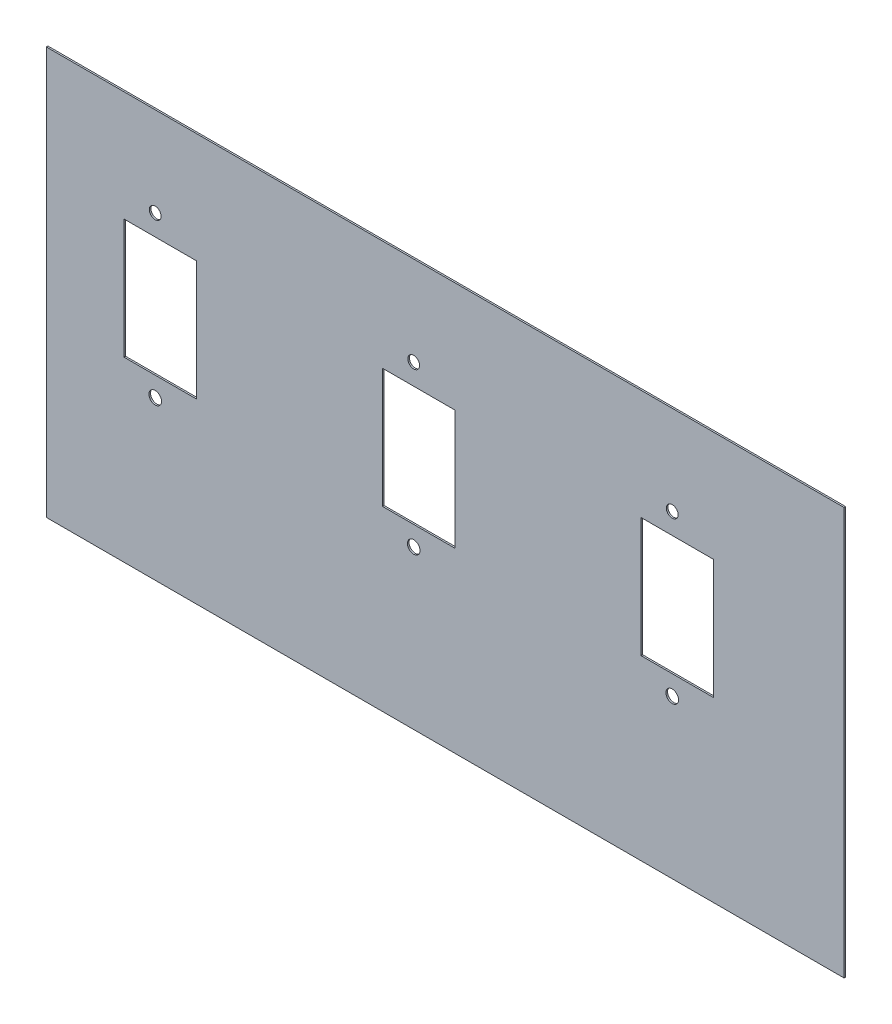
ISO-10303-21;
HEADER;
FILE_DESCRIPTION(('STEP AP214'),'2;1');
FILE_NAME('part.step','',(''),(''),'','','');
FILE_SCHEMA(('AUTOMOTIVE_DESIGN { 1 0 10303 214 1 1 1 1 }'));
ENDSEC;
DATA;
#1=APPLICATION_CONTEXT('core data for automotive mechanical design processes');
#2=APPLICATION_PROTOCOL_DEFINITION('international standard','automotive_design',2000,#1);
#3=PRODUCT_CONTEXT('',#1,'mechanical');
#4=PRODUCT('Part','Part','',(#3));
#5=PRODUCT_RELATED_PRODUCT_CATEGORY('part','',(#4));
#6=PRODUCT_DEFINITION_FORMATION('','',#4);
#7=PRODUCT_DEFINITION_CONTEXT('part definition',#1,'design');
#8=PRODUCT_DEFINITION('design','',#6,#7);
#9=PRODUCT_DEFINITION_SHAPE('','',#8);
#10=(LENGTH_UNIT() NAMED_UNIT(*) SI_UNIT(.MILLI.,.METRE.));
#11=(NAMED_UNIT(*) PLANE_ANGLE_UNIT() SI_UNIT($,.RADIAN.));
#12=(NAMED_UNIT(*) SI_UNIT($,.STERADIAN.) SOLID_ANGLE_UNIT());
#13=UNCERTAINTY_MEASURE_WITH_UNIT(LENGTH_MEASURE(1.E-05),#10,'distance_accuracy_value','');
#14=(GEOMETRIC_REPRESENTATION_CONTEXT(3) GLOBAL_UNCERTAINTY_ASSIGNED_CONTEXT((#13)) GLOBAL_UNIT_ASSIGNED_CONTEXT((#10,
#11,#12)) REPRESENTATION_CONTEXT('',''));
#15=CARTESIAN_POINT('',(0.,0.,0.));
#16=DIRECTION('',(0.,0.,1.));
#17=DIRECTION('',(1.,0.,0.));
#18=AXIS2_PLACEMENT_3D('',#15,#16,#17);
#19=CARTESIAN_POINT('',(-292.934613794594,286.400756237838,2.54));
#20=DIRECTION('',(1.,0.,0.));
#21=DIRECTION('',(0.,0.,-1.));
#22=AXIS2_PLACEMENT_3D('',#19,#20,#21);
#23=PLANE('',#22);
#24=DIRECTION('',(0.,-1.,0.));
#25=VECTOR('',#24,1.);
#26=CARTESIAN_POINT('',(-292.934613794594,286.400756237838,0.));
#27=LINE('',#26,#25);
#28=CARTESIAN_POINT('',(-292.934613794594,286.400756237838,0.));
#29=VERTEX_POINT('',#28);
#30=CARTESIAN_POINT('',(-292.934613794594,-358.195332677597,0.));
#31=VERTEX_POINT('',#30);
#32=EDGE_CURVE('E172',#29,#31,#27,.T.);
#33=ORIENTED_EDGE('',*,*,#32,.T.);
#34=DIRECTION('',(0.,0.,-1.));
#35=VECTOR('',#34,1.);
#36=CARTESIAN_POINT('',(-292.934613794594,-358.195332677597,2260.77514278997));
#37=LINE('',#36,#35);
#38=CARTESIAN_POINT('',(-292.934613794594,-358.195332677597,2.54000000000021));
#39=VERTEX_POINT('',#38);
#40=EDGE_CURVE('E46',#39,#31,#37,.T.);
#41=ORIENTED_EDGE('',*,*,#40,.F.);
#42=DIRECTION('',(0.,-1.,0.));
#43=VECTOR('',#42,1.);
#44=CARTESIAN_POINT('',(-292.934613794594,286.400756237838,2.54));
#45=LINE('',#44,#43);
#46=CARTESIAN_POINT('',(-292.934613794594,286.400756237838,2.54));
#47=VERTEX_POINT('',#46);
#48=EDGE_CURVE('E157',#47,#39,#45,.T.);
#49=ORIENTED_EDGE('',*,*,#48,.F.);
#50=DIRECTION('',(0.,0.,-1.));
#51=VECTOR('',#50,1.);
#52=CARTESIAN_POINT('',(-292.934613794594,286.400756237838,2.54));
#53=LINE('',#52,#51);
#54=EDGE_CURVE('E166',#47,#29,#53,.T.);
#55=ORIENTED_EDGE('',*,*,#54,.T.);
#56=EDGE_LOOP('',(#33,#41,#49,#55));
#57=FACE_BOUND('',#56,.T.);
#58=ADVANCED_FACE('F31',(#57),#23,.F.);
#59=CARTESIAN_POINT('',(969.034750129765,286.400756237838,2.54));
#60=DIRECTION('',(-1.,0.,0.));
#61=DIRECTION('',(0.,-1.,0.));
#62=AXIS2_PLACEMENT_3D('',#59,#60,#61);
#63=PLANE('',#62);
#64=DIRECTION('',(0.,1.,0.));
#65=VECTOR('',#64,1.);
#66=CARTESIAN_POINT('',(969.034750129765,286.400756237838,2.54));
#67=LINE('',#66,#65);
#68=CARTESIAN_POINT('',(969.034750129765,-358.195332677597,2.54000000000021));
#69=VERTEX_POINT('',#68);
#70=CARTESIAN_POINT('',(969.034750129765,286.400756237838,2.54));
#71=VERTEX_POINT('',#70);
#72=EDGE_CURVE('E154',#69,#71,#67,.T.);
#73=ORIENTED_EDGE('',*,*,#72,.F.);
#74=DIRECTION('',(0.,0.,-1.));
#75=VECTOR('',#74,1.);
#76=CARTESIAN_POINT('',(969.034750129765,-358.195332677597,2260.77514278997));
#77=LINE('',#76,#75);
#78=CARTESIAN_POINT('',(969.034750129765,-358.195332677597,0.));
#79=VERTEX_POINT('',#78);
#80=EDGE_CURVE('E142',#69,#79,#77,.T.);
#81=ORIENTED_EDGE('',*,*,#80,.T.);
#82=DIRECTION('',(0.,1.,0.));
#83=VECTOR('',#82,1.);
#84=CARTESIAN_POINT('',(969.034750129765,286.400756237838,0.));
#85=LINE('',#84,#83);
#86=CARTESIAN_POINT('',(969.034750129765,286.400756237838,0.));
#87=VERTEX_POINT('',#86);
#88=EDGE_CURVE('E175',#79,#87,#85,.T.);
#89=ORIENTED_EDGE('',*,*,#88,.T.);
#90=DIRECTION('',(0.,0.,-1.));
#91=VECTOR('',#90,1.);
#92=CARTESIAN_POINT('',(969.034750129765,286.400756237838,2.54));
#93=LINE('',#92,#91);
#94=EDGE_CURVE('E162',#71,#87,#93,.T.);
#95=ORIENTED_EDGE('',*,*,#94,.F.);
#96=EDGE_LOOP('',(#73,#81,#89,#95));
#97=FACE_BOUND('',#96,.T.);
#98=ADVANCED_FACE('F160',(#97),#63,.F.);
#99=CARTESIAN_POINT('',(-292.934613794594,286.400756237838,2.54));
#100=DIRECTION('',(0.,-1.,0.));
#101=DIRECTION('',(0.,0.,-1.));
#102=AXIS2_PLACEMENT_3D('',#99,#100,#101);
#103=PLANE('',#102);
#104=DIRECTION('',(-1.,0.,0.));
#105=VECTOR('',#104,1.);
#106=CARTESIAN_POINT('',(-292.934613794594,286.400756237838,0.));
#107=LINE('',#106,#105);
#108=EDGE_CURVE('E168',#87,#29,#107,.T.);
#109=ORIENTED_EDGE('',*,*,#108,.T.);
#110=ORIENTED_EDGE('',*,*,#54,.F.);
#111=DIRECTION('',(-1.,0.,0.));
#112=VECTOR('',#111,1.);
#113=CARTESIAN_POINT('',(-292.934613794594,286.400756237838,2.54));
#114=LINE('',#113,#112);
#115=EDGE_CURVE('E164',#71,#47,#114,.T.);
#116=ORIENTED_EDGE('',*,*,#115,.F.);
#117=ORIENTED_EDGE('',*,*,#94,.T.);
#118=EDGE_LOOP('',(#109,#110,#116,#117));
#119=FACE_BOUND('',#118,.T.);
#120=ADVANCED_FACE('F272',(#119),#103,.F.);
#121=CARTESIAN_POINT('',(-292.934613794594,-1002.79142159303,2.54));
#122=DIRECTION('',(0.,0.,1.));
#123=DIRECTION('',(1.,0.,0.));
#124=AXIS2_PLACEMENT_3D('',#121,#122,#123);
#125=PLANE('',#124);
#126=DIRECTION('',(-1.,0.,0.));
#127=VECTOR('',#126,1.);
#128=CARTESIAN_POINT('',(-292.934613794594,-358.195332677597,2.54));
#129=LINE('',#128,#127);
#130=EDGE_CURVE('E145',#69,#39,#129,.T.);
#131=ORIENTED_EDGE('',*,*,#130,.F.);
#132=ORIENTED_EDGE('',*,*,#72,.T.);
#133=ORIENTED_EDGE('',*,*,#115,.T.);
#134=ORIENTED_EDGE('',*,*,#48,.T.);
#135=EDGE_LOOP('',(#131,#132,#133,#134));
#136=FACE_BOUND('',#135,.T.);
#137=CARTESIAN_POINT('',(697.196630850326,-108.095305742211,2.54));
#138=DIRECTION('',(0.,0.,1.));
#139=DIRECTION('',(1.,0.,0.));
#140=AXIS2_PLACEMENT_3D('',#137,#138,#139);
#141=CIRCLE('',#140,9.95883906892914);
#142=CARTESIAN_POINT('',(707.155469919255,-108.095305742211,2.54));
#143=VERTEX_POINT('',#142);
#144=EDGE_CURVE('E158',#143,#143,#141,.T.);
#145=ORIENTED_EDGE('',*,*,#144,.F.);
#146=EDGE_LOOP('',(#145));
#147=FACE_BOUND('',#146,.T.);
#148=CARTESIAN_POINT('',(697.196630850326,145.099046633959,2.54));
#149=DIRECTION('',(0.,0.,1.));
#150=DIRECTION('',(1.,0.,0.));
#151=AXIS2_PLACEMENT_3D('',#148,#149,#150);
#152=CIRCLE('',#151,9.33473781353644);
#153=CARTESIAN_POINT('',(706.531368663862,145.099046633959,2.54));
#154=VERTEX_POINT('',#153);
#155=EDGE_CURVE('E495',#154,#154,#152,.T.);
#156=ORIENTED_EDGE('',*,*,#155,.F.);
#157=EDGE_LOOP('',(#156));
#158=FACE_BOUND('',#157,.T.);
#159=CARTESIAN_POINT('',(288.256630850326,-108.095305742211,2.54));
#160=DIRECTION('',(0.,0.,1.));
#161=DIRECTION('',(1.,0.,0.));
#162=AXIS2_PLACEMENT_3D('',#159,#160,#161);
#163=CIRCLE('',#162,9.95883906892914);
#164=CARTESIAN_POINT('',(298.215469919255,-108.095305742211,2.54));
#165=VERTEX_POINT('',#164);
#166=EDGE_CURVE('E501',#165,#165,#163,.T.);
#167=ORIENTED_EDGE('',*,*,#166,.F.);
#168=EDGE_LOOP('',(#167));
#169=FACE_BOUND('',#168,.T.);
#170=CARTESIAN_POINT('',(288.256630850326,145.099046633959,2.54));
#171=DIRECTION('',(0.,0.,1.));
#172=DIRECTION('',(1.,0.,0.));
#173=AXIS2_PLACEMENT_3D('',#170,#171,#172);
#174=CIRCLE('',#173,9.33473781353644);
#175=CARTESIAN_POINT('',(297.591368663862,145.099046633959,2.54));
#176=VERTEX_POINT('',#175);
#177=EDGE_CURVE('E507',#176,#176,#174,.T.);
#178=ORIENTED_EDGE('',*,*,#177,.F.);
#179=EDGE_LOOP('',(#178));
#180=FACE_BOUND('',#179,.T.);
#181=CARTESIAN_POINT('',(-120.683369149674,-108.095305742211,2.54));
#182=DIRECTION('',(0.,0.,1.));
#183=DIRECTION('',(1.,0.,0.));
#184=AXIS2_PLACEMENT_3D('',#181,#182,#183);
#185=CIRCLE('',#184,9.95883906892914);
#186=CARTESIAN_POINT('',(-110.724530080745,-108.095305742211,2.54));
#187=VERTEX_POINT('',#186);
#188=EDGE_CURVE('E513',#187,#187,#185,.T.);
#189=ORIENTED_EDGE('',*,*,#188,.F.);
#190=EDGE_LOOP('',(#189));
#191=FACE_BOUND('',#190,.T.);
#192=CARTESIAN_POINT('',(-120.683369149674,145.099046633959,2.54));
#193=DIRECTION('',(0.,0.,1.));
#194=DIRECTION('',(1.,0.,0.));
#195=AXIS2_PLACEMENT_3D('',#192,#193,#194);
#196=CIRCLE('',#195,9.33473781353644);
#197=CARTESIAN_POINT('',(-111.348631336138,145.099046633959,2.54));
#198=VERTEX_POINT('',#197);
#199=EDGE_CURVE('E519',#198,#198,#196,.T.);
#200=ORIENTED_EDGE('',*,*,#199,.F.);
#201=EDGE_LOOP('',(#200));
#202=FACE_BOUND('',#201,.T.);
#203=DIRECTION('',(0.,-1.,0.));
#204=VECTOR('',#203,1.);
#205=CARTESIAN_POINT('',(-170.073739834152,112.096614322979,2.54));
#206=LINE('',#205,#204);
#207=CARTESIAN_POINT('',(-170.073739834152,112.096614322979,2.54));
#208=VERTEX_POINT('',#207);
#209=CARTESIAN_POINT('',(-170.073739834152,-77.1861627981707,2.54));
#210=VERTEX_POINT('',#209);
#211=EDGE_CURVE('E525',#208,#210,#206,.T.);
#212=ORIENTED_EDGE('',*,*,#211,.F.);
#213=DIRECTION('',(-1.,0.,0.));
#214=VECTOR('',#213,1.);
#215=CARTESIAN_POINT('',(-170.073739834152,112.096614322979,2.54));
#216=LINE('',#215,#214);
#217=CARTESIAN_POINT('',(-55.6475194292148,112.096614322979,2.54));
#218=VERTEX_POINT('',#217);
#219=EDGE_CURVE('E532',#218,#208,#216,.T.);
#220=ORIENTED_EDGE('',*,*,#219,.F.);
#221=DIRECTION('',(0.,1.,0.));
#222=VECTOR('',#221,1.);
#223=CARTESIAN_POINT('',(-55.6475194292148,112.096614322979,2.54));
#224=LINE('',#223,#222);
#225=CARTESIAN_POINT('',(-55.6475194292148,-77.1861627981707,2.54));
#226=VERTEX_POINT('',#225);
#227=EDGE_CURVE('E546',#226,#218,#224,.T.);
#228=ORIENTED_EDGE('',*,*,#227,.F.);
#229=DIRECTION('',(1.,0.,0.));
#230=VECTOR('',#229,1.);
#231=CARTESIAN_POINT('',(-170.073739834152,-77.1861627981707,2.54));
#232=LINE('',#231,#230);
#233=EDGE_CURVE('E543',#210,#226,#232,.T.);
#234=ORIENTED_EDGE('',*,*,#233,.F.);
#235=EDGE_LOOP('',(#212,#220,#228,#234));
#236=FACE_BOUND('',#235,.T.);
#237=DIRECTION('',(0.,-1.,0.));
#238=VECTOR('',#237,1.);
#239=CARTESIAN_POINT('',(238.866260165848,112.096614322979,2.54));
#240=LINE('',#239,#238);
#241=CARTESIAN_POINT('',(238.866260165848,112.096614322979,2.54));
#242=VERTEX_POINT('',#241);
#243=CARTESIAN_POINT('',(238.866260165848,-77.1861627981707,2.54));
#244=VERTEX_POINT('',#243);
#245=EDGE_CURVE('E182',#242,#244,#240,.T.);
#246=ORIENTED_EDGE('',*,*,#245,.F.);
#247=DIRECTION('',(-1.,0.,0.));
#248=VECTOR('',#247,1.);
#249=CARTESIAN_POINT('',(238.866260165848,112.096614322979,2.54));
#250=LINE('',#249,#248);
#251=CARTESIAN_POINT('',(353.292480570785,112.096614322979,2.54));
#252=VERTEX_POINT('',#251);
#253=EDGE_CURVE('E184',#252,#242,#250,.T.);
#254=ORIENTED_EDGE('',*,*,#253,.F.);
#255=DIRECTION('',(0.,1.,0.));
#256=VECTOR('',#255,1.);
#257=CARTESIAN_POINT('',(353.292480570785,112.096614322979,2.54));
#258=LINE('',#257,#256);
#259=CARTESIAN_POINT('',(353.292480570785,-77.1861627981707,2.54));
#260=VERTEX_POINT('',#259);
#261=EDGE_CURVE('E187',#260,#252,#258,.T.);
#262=ORIENTED_EDGE('',*,*,#261,.F.);
#263=DIRECTION('',(1.,0.,0.));
#264=VECTOR('',#263,1.);
#265=CARTESIAN_POINT('',(238.866260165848,-77.1861627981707,2.54));
#266=LINE('',#265,#264);
#267=EDGE_CURVE('E190',#244,#260,#266,.T.);
#268=ORIENTED_EDGE('',*,*,#267,.F.);
#269=EDGE_LOOP('',(#246,#254,#262,#268));
#270=FACE_BOUND('',#269,.T.);
#271=DIRECTION('',(0.,-1.,0.));
#272=VECTOR('',#271,1.);
#273=CARTESIAN_POINT('',(647.806260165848,112.096614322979,2.54));
#274=LINE('',#273,#272);
#275=CARTESIAN_POINT('',(647.806260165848,112.096614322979,2.54));
#276=VERTEX_POINT('',#275);
#277=CARTESIAN_POINT('',(647.806260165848,-77.1861627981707,2.54));
#278=VERTEX_POINT('',#277);
#279=EDGE_CURVE('E214',#276,#278,#274,.T.);
#280=ORIENTED_EDGE('',*,*,#279,.F.);
#281=DIRECTION('',(-1.,0.,0.));
#282=VECTOR('',#281,1.);
#283=CARTESIAN_POINT('',(647.806260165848,112.096614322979,2.54));
#284=LINE('',#283,#282);
#285=CARTESIAN_POINT('',(762.232480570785,112.096614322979,2.54));
#286=VERTEX_POINT('',#285);
#287=EDGE_CURVE('E216',#286,#276,#284,.T.);
#288=ORIENTED_EDGE('',*,*,#287,.F.);
#289=DIRECTION('',(0.,1.,0.));
#290=VECTOR('',#289,1.);
#291=CARTESIAN_POINT('',(762.232480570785,112.096614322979,2.54));
#292=LINE('',#291,#290);
#293=CARTESIAN_POINT('',(762.232480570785,-77.1861627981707,2.54));
#294=VERTEX_POINT('',#293);
#295=EDGE_CURVE('E219',#294,#286,#292,.T.);
#296=ORIENTED_EDGE('',*,*,#295,.F.);
#297=DIRECTION('',(1.,0.,0.));
#298=VECTOR('',#297,1.);
#299=CARTESIAN_POINT('',(647.806260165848,-77.1861627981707,2.54));
#300=LINE('',#299,#298);
#301=EDGE_CURVE('E222',#278,#294,#300,.T.);
#302=ORIENTED_EDGE('',*,*,#301,.F.);
#303=EDGE_LOOP('',(#280,#288,#296,#302));
#304=FACE_BOUND('',#303,.T.);
#305=ADVANCED_FACE('F152',(#136,#147,#158,#169,#180,#191,#202,#236,#270,#304),#125,.T.);
#306=CARTESIAN_POINT('',(-292.934613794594,-1002.79142159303,0.));
#307=DIRECTION('',(0.,0.,1.));
#308=DIRECTION('',(1.,0.,0.));
#309=AXIS2_PLACEMENT_3D('',#306,#307,#308);
#310=PLANE('',#309);
#311=CARTESIAN_POINT('',(697.196630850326,-108.095305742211,0.));
#312=DIRECTION('',(0.,0.,1.));
#313=DIRECTION('',(1.,0.,0.));
#314=AXIS2_PLACEMENT_3D('',#311,#312,#313);
#315=CIRCLE('',#314,9.95883906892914);
#316=CARTESIAN_POINT('',(707.155469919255,-108.095305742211,0.));
#317=VERTEX_POINT('',#316);
#318=EDGE_CURVE('E491',#317,#317,#315,.T.);
#319=ORIENTED_EDGE('',*,*,#318,.T.);
#320=EDGE_LOOP('',(#319));
#321=FACE_BOUND('',#320,.T.);
#322=CARTESIAN_POINT('',(697.196630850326,145.099046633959,0.));
#323=DIRECTION('',(0.,0.,1.));
#324=DIRECTION('',(1.,0.,0.));
#325=AXIS2_PLACEMENT_3D('',#322,#323,#324);
#326=CIRCLE('',#325,9.33473781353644);
#327=CARTESIAN_POINT('',(706.531368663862,145.099046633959,0.));
#328=VERTEX_POINT('',#327);
#329=EDGE_CURVE('E498',#328,#328,#326,.T.);
#330=ORIENTED_EDGE('',*,*,#329,.T.);
#331=EDGE_LOOP('',(#330));
#332=FACE_BOUND('',#331,.T.);
#333=CARTESIAN_POINT('',(288.256630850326,-108.095305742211,0.));
#334=DIRECTION('',(0.,0.,1.));
#335=DIRECTION('',(1.,0.,0.));
#336=AXIS2_PLACEMENT_3D('',#333,#334,#335);
#337=CIRCLE('',#336,9.95883906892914);
#338=CARTESIAN_POINT('',(298.215469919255,-108.095305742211,0.));
#339=VERTEX_POINT('',#338);
#340=EDGE_CURVE('E504',#339,#339,#337,.T.);
#341=ORIENTED_EDGE('',*,*,#340,.T.);
#342=EDGE_LOOP('',(#341));
#343=FACE_BOUND('',#342,.T.);
#344=CARTESIAN_POINT('',(288.256630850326,145.099046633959,0.));
#345=DIRECTION('',(0.,0.,1.));
#346=DIRECTION('',(1.,0.,0.));
#347=AXIS2_PLACEMENT_3D('',#344,#345,#346);
#348=CIRCLE('',#347,9.33473781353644);
#349=CARTESIAN_POINT('',(297.591368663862,145.099046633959,0.));
#350=VERTEX_POINT('',#349);
#351=EDGE_CURVE('E510',#350,#350,#348,.T.);
#352=ORIENTED_EDGE('',*,*,#351,.T.);
#353=EDGE_LOOP('',(#352));
#354=FACE_BOUND('',#353,.T.);
#355=CARTESIAN_POINT('',(-120.683369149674,-108.095305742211,0.));
#356=DIRECTION('',(0.,0.,1.));
#357=DIRECTION('',(1.,0.,0.));
#358=AXIS2_PLACEMENT_3D('',#355,#356,#357);
#359=CIRCLE('',#358,9.95883906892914);
#360=CARTESIAN_POINT('',(-110.724530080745,-108.095305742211,0.));
#361=VERTEX_POINT('',#360);
#362=EDGE_CURVE('E516',#361,#361,#359,.T.);
#363=ORIENTED_EDGE('',*,*,#362,.T.);
#364=EDGE_LOOP('',(#363));
#365=FACE_BOUND('',#364,.T.);
#366=CARTESIAN_POINT('',(-120.683369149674,145.099046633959,0.));
#367=DIRECTION('',(0.,0.,1.));
#368=DIRECTION('',(1.,0.,0.));
#369=AXIS2_PLACEMENT_3D('',#366,#367,#368);
#370=CIRCLE('',#369,9.33473781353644);
#371=CARTESIAN_POINT('',(-111.348631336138,145.099046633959,0.));
#372=VERTEX_POINT('',#371);
#373=EDGE_CURVE('E522',#372,#372,#370,.T.);
#374=ORIENTED_EDGE('',*,*,#373,.T.);
#375=EDGE_LOOP('',(#374));
#376=FACE_BOUND('',#375,.T.);
#377=DIRECTION('',(-1.,0.,0.));
#378=VECTOR('',#377,1.);
#379=CARTESIAN_POINT('',(-170.073739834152,112.096614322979,0.));
#380=LINE('',#379,#378);
#381=CARTESIAN_POINT('',(-55.6475194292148,112.096614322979,0.));
#382=VERTEX_POINT('',#381);
#383=CARTESIAN_POINT('',(-170.073739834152,112.096614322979,0.));
#384=VERTEX_POINT('',#383);
#385=EDGE_CURVE('E538',#382,#384,#380,.T.);
#386=ORIENTED_EDGE('',*,*,#385,.T.);
#387=DIRECTION('',(0.,-1.,0.));
#388=VECTOR('',#387,1.);
#389=CARTESIAN_POINT('',(-170.073739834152,112.096614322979,0.));
#390=LINE('',#389,#388);
#391=CARTESIAN_POINT('',(-170.073739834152,-77.1861627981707,0.));
#392=VERTEX_POINT('',#391);
#393=EDGE_CURVE('E528',#384,#392,#390,.T.);
#394=ORIENTED_EDGE('',*,*,#393,.T.);
#395=DIRECTION('',(1.,0.,0.));
#396=VECTOR('',#395,1.);
#397=CARTESIAN_POINT('',(-170.073739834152,-77.1861627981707,0.));
#398=LINE('',#397,#396);
#399=CARTESIAN_POINT('',(-55.6475194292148,-77.1861627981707,0.));
#400=VERTEX_POINT('',#399);
#401=EDGE_CURVE('E531',#392,#400,#398,.T.);
#402=ORIENTED_EDGE('',*,*,#401,.T.);
#403=DIRECTION('',(0.,1.,0.));
#404=VECTOR('',#403,1.);
#405=CARTESIAN_POINT('',(-55.6475194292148,112.096614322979,0.));
#406=LINE('',#405,#404);
#407=EDGE_CURVE('E535',#400,#382,#406,.T.);
#408=ORIENTED_EDGE('',*,*,#407,.T.);
#409=EDGE_LOOP('',(#386,#394,#402,#408));
#410=FACE_BOUND('',#409,.T.);
#411=ORIENTED_EDGE('',*,*,#88,.F.);
#412=DIRECTION('',(-1.,0.,0.));
#413=VECTOR('',#412,1.);
#414=CARTESIAN_POINT('',(-292.934613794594,-358.195332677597,0.));
#415=LINE('',#414,#413);
#416=EDGE_CURVE('E11',#79,#31,#415,.T.);
#417=ORIENTED_EDGE('',*,*,#416,.T.);
#418=ORIENTED_EDGE('',*,*,#32,.F.);
#419=ORIENTED_EDGE('',*,*,#108,.F.);
#420=EDGE_LOOP('',(#411,#417,#418,#419));
#421=FACE_BOUND('',#420,.T.);
#422=DIRECTION('',(0.,-1.,0.));
#423=VECTOR('',#422,1.);
#424=CARTESIAN_POINT('',(238.866260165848,112.096614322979,0.));
#425=LINE('',#424,#423);
#426=CARTESIAN_POINT('',(238.866260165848,112.096614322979,0.));
#427=VERTEX_POINT('',#426);
#428=CARTESIAN_POINT('',(238.866260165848,-77.1861627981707,0.));
#429=VERTEX_POINT('',#428);
#430=EDGE_CURVE('E193',#427,#429,#425,.T.);
#431=ORIENTED_EDGE('',*,*,#430,.T.);
#432=DIRECTION('',(1.,0.,0.));
#433=VECTOR('',#432,1.);
#434=CARTESIAN_POINT('',(238.866260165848,-77.1861627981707,0.));
#435=LINE('',#434,#433);
#436=CARTESIAN_POINT('',(353.292480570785,-77.1861627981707,0.));
#437=VERTEX_POINT('',#436);
#438=EDGE_CURVE('E195',#429,#437,#435,.T.);
#439=ORIENTED_EDGE('',*,*,#438,.T.);
#440=DIRECTION('',(0.,1.,0.));
#441=VECTOR('',#440,1.);
#442=CARTESIAN_POINT('',(353.292480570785,112.096614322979,0.));
#443=LINE('',#442,#441);
#444=CARTESIAN_POINT('',(353.292480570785,112.096614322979,0.));
#445=VERTEX_POINT('',#444);
#446=EDGE_CURVE('E197',#437,#445,#443,.T.);
#447=ORIENTED_EDGE('',*,*,#446,.T.);
#448=DIRECTION('',(-1.,0.,0.));
#449=VECTOR('',#448,1.);
#450=CARTESIAN_POINT('',(238.866260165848,112.096614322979,0.));
#451=LINE('',#450,#449);
#452=EDGE_CURVE('E199',#445,#427,#451,.T.);
#453=ORIENTED_EDGE('',*,*,#452,.T.);
#454=EDGE_LOOP('',(#431,#439,#447,#453));
#455=FACE_BOUND('',#454,.T.);
#456=DIRECTION('',(0.,-1.,0.));
#457=VECTOR('',#456,1.);
#458=CARTESIAN_POINT('',(647.806260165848,112.096614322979,0.));
#459=LINE('',#458,#457);
#460=CARTESIAN_POINT('',(647.806260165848,112.096614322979,0.));
#461=VERTEX_POINT('',#460);
#462=CARTESIAN_POINT('',(647.806260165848,-77.1861627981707,0.));
#463=VERTEX_POINT('',#462);
#464=EDGE_CURVE('E53',#461,#463,#459,.T.);
#465=ORIENTED_EDGE('',*,*,#464,.T.);
#466=DIRECTION('',(1.,0.,0.));
#467=VECTOR('',#466,1.);
#468=CARTESIAN_POINT('',(647.806260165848,-77.1861627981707,0.));
#469=LINE('',#468,#467);
#470=CARTESIAN_POINT('',(762.232480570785,-77.1861627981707,0.));
#471=VERTEX_POINT('',#470);
#472=EDGE_CURVE('E226',#463,#471,#469,.T.);
#473=ORIENTED_EDGE('',*,*,#472,.T.);
#474=DIRECTION('',(0.,1.,0.));
#475=VECTOR('',#474,1.);
#476=CARTESIAN_POINT('',(762.232480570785,112.096614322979,0.));
#477=LINE('',#476,#475);
#478=CARTESIAN_POINT('',(762.232480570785,112.096614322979,0.));
#479=VERTEX_POINT('',#478);
#480=EDGE_CURVE('E228',#471,#479,#477,.T.);
#481=ORIENTED_EDGE('',*,*,#480,.T.);
#482=DIRECTION('',(-1.,0.,0.));
#483=VECTOR('',#482,1.);
#484=CARTESIAN_POINT('',(647.806260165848,112.096614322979,0.));
#485=LINE('',#484,#483);
#486=EDGE_CURVE('E230',#479,#461,#485,.T.);
#487=ORIENTED_EDGE('',*,*,#486,.T.);
#488=EDGE_LOOP('',(#465,#473,#481,#487));
#489=FACE_BOUND('',#488,.T.);
#490=ADVANCED_FACE('F306',(#321,#332,#343,#354,#365,#376,#410,#421,#455,#489),#310,.F.);
#491=CARTESIAN_POINT('',(-170.073739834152,112.096614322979,0.));
#492=DIRECTION('',(-1.,0.,0.));
#493=DIRECTION('',(0.,0.,1.));
#494=AXIS2_PLACEMENT_3D('',#491,#492,#493);
#495=PLANE('',#494);
#496=ORIENTED_EDGE('',*,*,#211,.T.);
#497=DIRECTION('',(0.,0.,1.));
#498=VECTOR('',#497,1.);
#499=CARTESIAN_POINT('',(-170.073739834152,-77.1861627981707,0.));
#500=LINE('',#499,#498);
#501=EDGE_CURVE('E541',#392,#210,#500,.T.);
#502=ORIENTED_EDGE('',*,*,#501,.F.);
#503=ORIENTED_EDGE('',*,*,#393,.F.);
#504=DIRECTION('',(0.,0.,1.));
#505=VECTOR('',#504,1.);
#506=CARTESIAN_POINT('',(-170.073739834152,112.096614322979,0.));
#507=LINE('',#506,#505);
#508=EDGE_CURVE('E176',#384,#208,#507,.T.);
#509=ORIENTED_EDGE('',*,*,#508,.T.);
#510=EDGE_LOOP('',(#496,#502,#503,#509));
#511=FACE_BOUND('',#510,.T.);
#512=ADVANCED_FACE('F315',(#511),#495,.F.);
#513=CARTESIAN_POINT('',(-170.073739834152,112.096614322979,0.));
#514=DIRECTION('',(0.,1.,0.));
#515=DIRECTION('',(0.,0.,1.));
#516=AXIS2_PLACEMENT_3D('',#513,#514,#515);
#517=PLANE('',#516);
#518=ORIENTED_EDGE('',*,*,#219,.T.);
#519=ORIENTED_EDGE('',*,*,#508,.F.);
#520=ORIENTED_EDGE('',*,*,#385,.F.);
#521=DIRECTION('',(0.,0.,1.));
#522=VECTOR('',#521,1.);
#523=CARTESIAN_POINT('',(-55.6475194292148,112.096614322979,0.));
#524=LINE('',#523,#522);
#525=EDGE_CURVE('E552',#382,#218,#524,.T.);
#526=ORIENTED_EDGE('',*,*,#525,.T.);
#527=EDGE_LOOP('',(#518,#519,#520,#526));
#528=FACE_BOUND('',#527,.T.);
#529=ADVANCED_FACE('F322',(#528),#517,.F.);
#530=CARTESIAN_POINT('',(-55.6475194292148,112.096614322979,0.));
#531=DIRECTION('',(1.,0.,0.));
#532=DIRECTION('',(0.,0.,-1.));
#533=AXIS2_PLACEMENT_3D('',#530,#531,#532);
#534=PLANE('',#533);
#535=ORIENTED_EDGE('',*,*,#227,.T.);
#536=ORIENTED_EDGE('',*,*,#525,.F.);
#537=ORIENTED_EDGE('',*,*,#407,.F.);
#538=DIRECTION('',(0.,0.,1.));
#539=VECTOR('',#538,1.);
#540=CARTESIAN_POINT('',(-55.6475194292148,-77.1861627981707,0.));
#541=LINE('',#540,#539);
#542=EDGE_CURVE('E554',#400,#226,#541,.T.);
#543=ORIENTED_EDGE('',*,*,#542,.T.);
#544=EDGE_LOOP('',(#535,#536,#537,#543));
#545=FACE_BOUND('',#544,.T.);
#546=ADVANCED_FACE('F327',(#545),#534,.F.);
#547=CARTESIAN_POINT('',(-170.073739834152,-77.1861627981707,0.));
#548=DIRECTION('',(0.,-1.,0.));
#549=DIRECTION('',(0.,0.,-1.));
#550=AXIS2_PLACEMENT_3D('',#547,#548,#549);
#551=PLANE('',#550);
#552=ORIENTED_EDGE('',*,*,#233,.T.);
#553=ORIENTED_EDGE('',*,*,#542,.F.);
#554=ORIENTED_EDGE('',*,*,#401,.F.);
#555=ORIENTED_EDGE('',*,*,#501,.T.);
#556=EDGE_LOOP('',(#552,#553,#554,#555));
#557=FACE_BOUND('',#556,.T.);
#558=ADVANCED_FACE('F324',(#557),#551,.F.);
#559=CARTESIAN_POINT('',(-120.683369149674,145.099046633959,0.));
#560=DIRECTION('',(0.,0.,1.));
#561=DIRECTION('',(1.,0.,0.));
#562=AXIS2_PLACEMENT_3D('',#559,#560,#561);
#563=CYLINDRICAL_SURFACE('',#562,9.33473781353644);
#564=ORIENTED_EDGE('',*,*,#373,.F.);
#565=EDGE_LOOP('',(#564));
#566=FACE_BOUND('',#565,.T.);
#567=ORIENTED_EDGE('',*,*,#199,.T.);
#568=EDGE_LOOP('',(#567));
#569=FACE_BOUND('',#568,.T.);
#570=ADVANCED_FACE('F294',(#566,#569),#563,.F.);
#571=CARTESIAN_POINT('',(-120.683369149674,-108.095305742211,0.));
#572=DIRECTION('',(0.,0.,1.));
#573=DIRECTION('',(1.,0.,0.));
#574=AXIS2_PLACEMENT_3D('',#571,#572,#573);
#575=CYLINDRICAL_SURFACE('',#574,9.95883906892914);
#576=ORIENTED_EDGE('',*,*,#362,.F.);
#577=EDGE_LOOP('',(#576));
#578=FACE_BOUND('',#577,.T.);
#579=ORIENTED_EDGE('',*,*,#188,.T.);
#580=EDGE_LOOP('',(#579));
#581=FACE_BOUND('',#580,.T.);
#582=ADVANCED_FACE('F289',(#578,#581),#575,.F.);
#583=CARTESIAN_POINT('',(238.866260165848,-77.1861627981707,0.));
#584=DIRECTION('',(0.,-1.,0.));
#585=DIRECTION('',(0.,0.,-1.));
#586=AXIS2_PLACEMENT_3D('',#583,#584,#585);
#587=PLANE('',#586);
#588=ORIENTED_EDGE('',*,*,#267,.T.);
#589=DIRECTION('',(0.,0.,1.));
#590=VECTOR('',#589,1.);
#591=CARTESIAN_POINT('',(353.292480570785,-77.1861627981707,0.));
#592=LINE('',#591,#590);
#593=EDGE_CURVE('E211',#437,#260,#592,.T.);
#594=ORIENTED_EDGE('',*,*,#593,.F.);
#595=ORIENTED_EDGE('',*,*,#438,.F.);
#596=DIRECTION('',(0.,0.,1.));
#597=VECTOR('',#596,1.);
#598=CARTESIAN_POINT('',(238.866260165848,-77.1861627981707,0.));
#599=LINE('',#598,#597);
#600=EDGE_CURVE('E202',#429,#244,#599,.T.);
#601=ORIENTED_EDGE('',*,*,#600,.T.);
#602=EDGE_LOOP('',(#588,#594,#595,#601));
#603=FACE_BOUND('',#602,.T.);
#604=ADVANCED_FACE('F286',(#603),#587,.F.);
#605=CARTESIAN_POINT('',(353.292480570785,112.096614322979,0.));
#606=DIRECTION('',(1.,0.,0.));
#607=DIRECTION('',(0.,0.,-1.));
#608=AXIS2_PLACEMENT_3D('',#605,#606,#607);
#609=PLANE('',#608);
#610=ORIENTED_EDGE('',*,*,#261,.T.);
#611=DIRECTION('',(0.,0.,1.));
#612=VECTOR('',#611,1.);
#613=CARTESIAN_POINT('',(353.292480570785,112.096614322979,0.));
#614=LINE('',#613,#612);
#615=EDGE_CURVE('E208',#445,#252,#614,.T.);
#616=ORIENTED_EDGE('',*,*,#615,.F.);
#617=ORIENTED_EDGE('',*,*,#446,.F.);
#618=ORIENTED_EDGE('',*,*,#593,.T.);
#619=EDGE_LOOP('',(#610,#616,#617,#618));
#620=FACE_BOUND('',#619,.T.);
#621=ADVANCED_FACE('F283',(#620),#609,.F.);
#622=CARTESIAN_POINT('',(238.866260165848,112.096614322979,0.));
#623=DIRECTION('',(0.,1.,0.));
#624=DIRECTION('',(0.,0.,1.));
#625=AXIS2_PLACEMENT_3D('',#622,#623,#624);
#626=PLANE('',#625);
#627=ORIENTED_EDGE('',*,*,#253,.T.);
#628=DIRECTION('',(0.,0.,1.));
#629=VECTOR('',#628,1.);
#630=CARTESIAN_POINT('',(238.866260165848,112.096614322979,0.));
#631=LINE('',#630,#629);
#632=EDGE_CURVE('E205',#427,#242,#631,.T.);
#633=ORIENTED_EDGE('',*,*,#632,.F.);
#634=ORIENTED_EDGE('',*,*,#452,.F.);
#635=ORIENTED_EDGE('',*,*,#615,.T.);
#636=EDGE_LOOP('',(#627,#633,#634,#635));
#637=FACE_BOUND('',#636,.T.);
#638=ADVANCED_FACE('F279',(#637),#626,.F.);
#639=CARTESIAN_POINT('',(238.866260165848,112.096614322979,0.));
#640=DIRECTION('',(-1.,0.,0.));
#641=DIRECTION('',(0.,0.,1.));
#642=AXIS2_PLACEMENT_3D('',#639,#640,#641);
#643=PLANE('',#642);
#644=ORIENTED_EDGE('',*,*,#245,.T.);
#645=ORIENTED_EDGE('',*,*,#600,.F.);
#646=ORIENTED_EDGE('',*,*,#430,.F.);
#647=ORIENTED_EDGE('',*,*,#632,.T.);
#648=EDGE_LOOP('',(#644,#645,#646,#647));
#649=FACE_BOUND('',#648,.T.);
#650=ADVANCED_FACE('F276',(#649),#643,.F.);
#651=CARTESIAN_POINT('',(647.806260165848,-77.1861627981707,0.));
#652=DIRECTION('',(0.,-1.,0.));
#653=DIRECTION('',(0.,0.,-1.));
#654=AXIS2_PLACEMENT_3D('',#651,#652,#653);
#655=PLANE('',#654);
#656=ORIENTED_EDGE('',*,*,#301,.T.);
#657=DIRECTION('',(0.,0.,1.));
#658=VECTOR('',#657,1.);
#659=CARTESIAN_POINT('',(762.232480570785,-77.1861627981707,0.));
#660=LINE('',#659,#658);
#661=EDGE_CURVE('E39',#471,#294,#660,.T.);
#662=ORIENTED_EDGE('',*,*,#661,.F.);
#663=ORIENTED_EDGE('',*,*,#472,.F.);
#664=DIRECTION('',(0.,0.,1.));
#665=VECTOR('',#664,1.);
#666=CARTESIAN_POINT('',(647.806260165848,-77.1861627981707,0.));
#667=LINE('',#666,#665);
#668=EDGE_CURVE('E232',#463,#278,#667,.T.);
#669=ORIENTED_EDGE('',*,*,#668,.T.);
#670=EDGE_LOOP('',(#656,#662,#663,#669));
#671=FACE_BOUND('',#670,.T.);
#672=ADVANCED_FACE('F33',(#671),#655,.F.);
#673=CARTESIAN_POINT('',(762.232480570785,112.096614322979,0.));
#674=DIRECTION('',(1.,0.,0.));
#675=DIRECTION('',(0.,0.,-1.));
#676=AXIS2_PLACEMENT_3D('',#673,#674,#675);
#677=PLANE('',#676);
#678=ORIENTED_EDGE('',*,*,#295,.T.);
#679=DIRECTION('',(0.,0.,1.));
#680=VECTOR('',#679,1.);
#681=CARTESIAN_POINT('',(762.232480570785,112.096614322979,0.));
#682=LINE('',#681,#680);
#683=EDGE_CURVE('E237',#479,#286,#682,.T.);
#684=ORIENTED_EDGE('',*,*,#683,.F.);
#685=ORIENTED_EDGE('',*,*,#480,.F.);
#686=ORIENTED_EDGE('',*,*,#661,.T.);
#687=EDGE_LOOP('',(#678,#684,#685,#686));
#688=FACE_BOUND('',#687,.T.);
#689=ADVANCED_FACE('F243',(#688),#677,.F.);
#690=CARTESIAN_POINT('',(647.806260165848,112.096614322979,0.));
#691=DIRECTION('',(0.,1.,0.));
#692=DIRECTION('',(0.,0.,1.));
#693=AXIS2_PLACEMENT_3D('',#690,#691,#692);
#694=PLANE('',#693);
#695=ORIENTED_EDGE('',*,*,#287,.T.);
#696=DIRECTION('',(0.,0.,1.));
#697=VECTOR('',#696,1.);
#698=CARTESIAN_POINT('',(647.806260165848,112.096614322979,0.));
#699=LINE('',#698,#697);
#700=EDGE_CURVE('E235',#461,#276,#699,.T.);
#701=ORIENTED_EDGE('',*,*,#700,.F.);
#702=ORIENTED_EDGE('',*,*,#486,.F.);
#703=ORIENTED_EDGE('',*,*,#683,.T.);
#704=EDGE_LOOP('',(#695,#701,#702,#703));
#705=FACE_BOUND('',#704,.T.);
#706=ADVANCED_FACE('F251',(#705),#694,.F.);
#707=CARTESIAN_POINT('',(647.806260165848,112.096614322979,0.));
#708=DIRECTION('',(-1.,0.,0.));
#709=DIRECTION('',(0.,0.,1.));
#710=AXIS2_PLACEMENT_3D('',#707,#708,#709);
#711=PLANE('',#710);
#712=ORIENTED_EDGE('',*,*,#279,.T.);
#713=ORIENTED_EDGE('',*,*,#668,.F.);
#714=ORIENTED_EDGE('',*,*,#464,.F.);
#715=ORIENTED_EDGE('',*,*,#700,.T.);
#716=EDGE_LOOP('',(#712,#713,#714,#715));
#717=FACE_BOUND('',#716,.T.);
#718=ADVANCED_FACE('F253',(#717),#711,.F.);
#719=CARTESIAN_POINT('',(288.256630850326,145.099046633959,0.));
#720=DIRECTION('',(0.,0.,1.));
#721=DIRECTION('',(1.,0.,0.));
#722=AXIS2_PLACEMENT_3D('',#719,#720,#721);
#723=CYLINDRICAL_SURFACE('',#722,9.33473781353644);
#724=ORIENTED_EDGE('',*,*,#351,.F.);
#725=EDGE_LOOP('',(#724));
#726=FACE_BOUND('',#725,.T.);
#727=ORIENTED_EDGE('',*,*,#177,.T.);
#728=EDGE_LOOP('',(#727));
#729=FACE_BOUND('',#728,.T.);
#730=ADVANCED_FACE('F255',(#726,#729),#723,.F.);
#731=CARTESIAN_POINT('',(288.256630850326,-108.095305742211,0.));
#732=DIRECTION('',(0.,0.,1.));
#733=DIRECTION('',(1.,0.,0.));
#734=AXIS2_PLACEMENT_3D('',#731,#732,#733);
#735=CYLINDRICAL_SURFACE('',#734,9.95883906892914);
#736=ORIENTED_EDGE('',*,*,#340,.F.);
#737=EDGE_LOOP('',(#736));
#738=FACE_BOUND('',#737,.T.);
#739=ORIENTED_EDGE('',*,*,#166,.T.);
#740=EDGE_LOOP('',(#739));
#741=FACE_BOUND('',#740,.T.);
#742=ADVANCED_FACE('F261',(#738,#741),#735,.F.);
#743=CARTESIAN_POINT('',(697.196630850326,145.099046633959,0.));
#744=DIRECTION('',(0.,0.,1.));
#745=DIRECTION('',(1.,0.,0.));
#746=AXIS2_PLACEMENT_3D('',#743,#744,#745);
#747=CYLINDRICAL_SURFACE('',#746,9.33473781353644);
#748=ORIENTED_EDGE('',*,*,#329,.F.);
#749=EDGE_LOOP('',(#748));
#750=FACE_BOUND('',#749,.T.);
#751=ORIENTED_EDGE('',*,*,#155,.T.);
#752=EDGE_LOOP('',(#751));
#753=FACE_BOUND('',#752,.T.);
#754=ADVANCED_FACE('F340',(#750,#753),#747,.F.);
#755=CARTESIAN_POINT('',(697.196630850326,-108.095305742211,0.));
#756=DIRECTION('',(0.,0.,1.));
#757=DIRECTION('',(1.,0.,0.));
#758=AXIS2_PLACEMENT_3D('',#755,#756,#757);
#759=CYLINDRICAL_SURFACE('',#758,9.95883906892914);
#760=ORIENTED_EDGE('',*,*,#318,.F.);
#761=EDGE_LOOP('',(#760));
#762=FACE_BOUND('',#761,.T.);
#763=ORIENTED_EDGE('',*,*,#144,.T.);
#764=EDGE_LOOP('',(#763));
#765=FACE_BOUND('',#764,.T.);
#766=ADVANCED_FACE('F344',(#762,#765),#759,.F.);
#767=CARTESIAN_POINT('',(-292.934613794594,-358.195332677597,2260.77514278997));
#768=DIRECTION('',(0.,1.,0.));
#769=DIRECTION('',(-1.,0.,0.));
#770=AXIS2_PLACEMENT_3D('',#767,#768,#769);
#771=PLANE('',#770);
#772=ORIENTED_EDGE('',*,*,#80,.F.);
#773=ORIENTED_EDGE('',*,*,#130,.T.);
#774=ORIENTED_EDGE('',*,*,#40,.T.);
#775=ORIENTED_EDGE('',*,*,#416,.F.);
#776=EDGE_LOOP('',(#772,#773,#774,#775));
#777=FACE_BOUND('',#776,.T.);
#778=ADVANCED_FACE('F144',(#777),#771,.F.);
#779=CLOSED_SHELL('',(#58,#98,#120,#305,#490,#512,#529,#546,#558,#570,#582,#604,#621,#638,#650,
#672,#689,#706,#718,#730,#742,#754,#766,#778));
#780=MANIFOLD_SOLID_BREP('B2',#779);
#781=ADVANCED_BREP_SHAPE_REPRESENTATION('',(#18,#780),#14);
#782=SHAPE_DEFINITION_REPRESENTATION(#9,#781);
ENDSEC;
END-ISO-10303-21;
